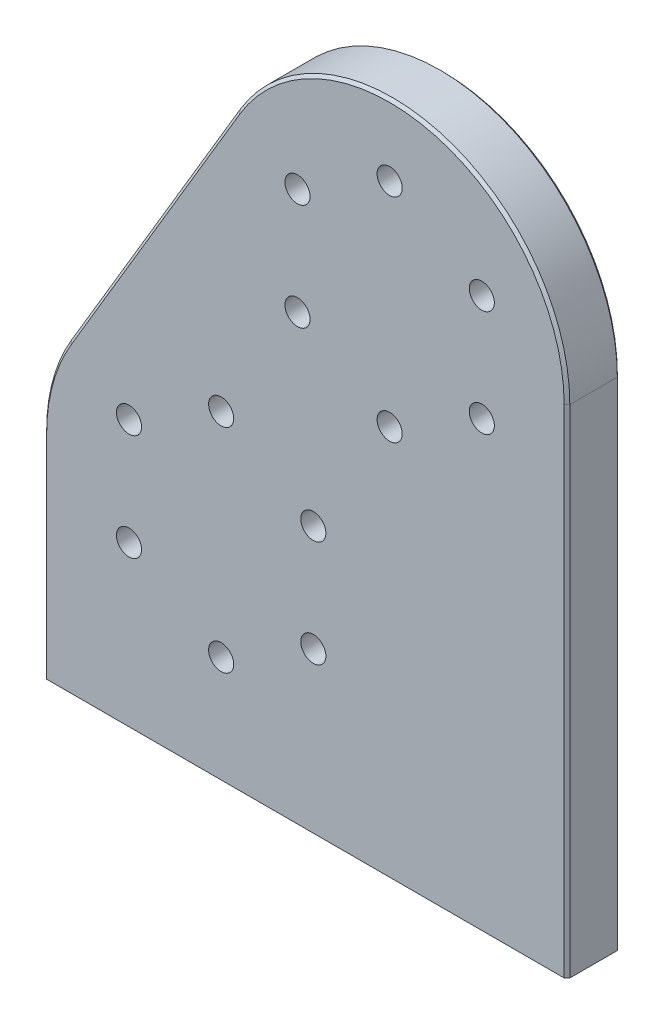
from build123d import *

# Parameters (mm, degrees)
EXTRUDE1_DEPTH                  = 4.7625
F_8_32_TAPPED_HOLE1_D           = 3.4544
F_8_32_TAPPED_HOLE1_DEPTH       = 20.1676
F_8_32_TAPPED_HOLE1_CBORE_D     = 4.1656
F_8_32_TAPPED_HOLE1_CBORE_DEPTH = 17.78
F_8_32_TAPPED_HOLE1_TIP         = 1.037806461
F_8_CLEARANCE_HOLE1_D           = 4.4958
SKETCH6_R                       = 2.38125
CUT_EXTRUDE1_DEPTH              = 12.7
CHAMFER1_SIZE                   = 0.508


with BuildPart() as part:
    # Sketch1 → Extrude1 (new, symmetric)
    with BuildSketch(Plane.XY):
        with BuildLine():
            Line((-27.300388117, 54.309605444), (2.862111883, 105.109605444))
            ThreePointArc((2.862111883, 105.109605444), (38.567117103, 119.517395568), (61.9125, 88.9))
            Line((61.9125, 88.9), (61.9125, 0))
            Line((61.9125, 0), (-31.75, 0))
            Line((-31.75, 0), (-31.75, 38.1))
            ThreePointArc((-31.75, 38.1), (-30.617395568, 46.504617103), (-27.300388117, 54.309605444))
        make_face()
    extrude(amount=EXTRUDE1_DEPTH, both=True)

    # 8-32 Tapped Hole1
    with Locations(Plane.XZ):
        with Locations((25.4, 0), (-25.4, 0)):
            CounterBoreHole(F_8_32_TAPPED_HOLE1_D / 2, F_8_32_TAPPED_HOLE1_CBORE_D / 2, F_8_32_TAPPED_HOLE1_CBORE_DEPTH, depth=F_8_32_TAPPED_HOLE1_DEPTH)
            with Locations((0, 0, -(F_8_32_TAPPED_HOLE1_DEPTH + F_8_32_TAPPED_HOLE1_TIP / 2))):  # 118° drill point
                Cone(0, F_8_32_TAPPED_HOLE1_D / 2, F_8_32_TAPPED_HOLE1_TIP, mode=Mode.SUBTRACT)

    # 8 Clearance Hole1 (through all)
    with Locations(Plane.XY.offset(4.7625)):
        with Locations((30.1625, 69.85), (13.664716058, 79.375), (46.660283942, 98.425), (30.1625, 107.95), (13.664716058, 98.425), (46.660283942, 79.375), (16.497783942, 47.625), (16.497783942, 28.575), (0, 57.15), (-16.497783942, 28.575), (-16.497783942, 47.625), (0, 19.05)):
            Hole(F_8_CLEARANCE_HOLE1_D / 2)

    # Sketch6 → Cut-Extrude1 (cut)
    with BuildSketch(Plane.XZ):
        with Locations(Location((0, 0, 0), (0, 0, 270))):
            Circle(SKETCH6_R)
        with Locations(Location((50.8, 0, 0), (0, 0, 270))):
            Circle(SKETCH6_R)
    extrude(amount=-CUT_EXTRUDE1_DEPTH, mode=Mode.SUBTRACT)

    # Chamfer1
    chamfer1_edges = [part.edges().sort_by_distance(p)[0] for p in [
        (-30.617395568, 46.504617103, 4.7625),
        (-31.75, 19.05, 4.7625),
        (61.9125, 44.45, 4.7625),
        (38.567117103, 119.517395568, 4.7625),
        (61.9125, 44.45, -4.7625),
        (-31.75, 19.05, -4.7625),
        (-30.617395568, 46.504617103, -4.7625),
        (-12.219138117, 79.709605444, 4.7625),
        (-12.219138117, 79.709605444, -4.7625),
        (38.567117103, 119.517395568, -4.7625),
    ]]
    chamfer(chamfer1_edges, length=CHAMFER1_SIZE)


solid = part.part
